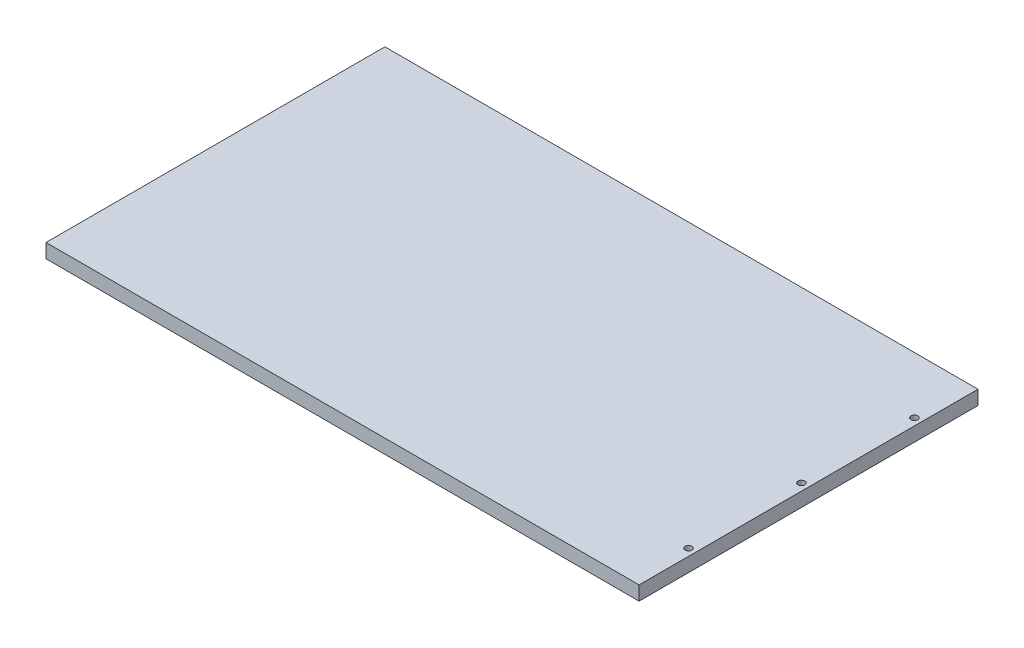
ISO-10303-21;
HEADER;
FILE_DESCRIPTION(('STEP AP214'),'2;1');
FILE_NAME('part.step','',(''),(''),'','','');
FILE_SCHEMA(('AUTOMOTIVE_DESIGN { 1 0 10303 214 1 1 1 1 }'));
ENDSEC;
DATA;
#1=APPLICATION_CONTEXT('core data for automotive mechanical design processes');
#2=APPLICATION_PROTOCOL_DEFINITION('international standard','automotive_design',2000,#1);
#3=PRODUCT_CONTEXT('',#1,'mechanical');
#4=PRODUCT('Part','Part','',(#3));
#5=PRODUCT_RELATED_PRODUCT_CATEGORY('part','',(#4));
#6=PRODUCT_DEFINITION_FORMATION('','',#4);
#7=PRODUCT_DEFINITION_CONTEXT('part definition',#1,'design');
#8=PRODUCT_DEFINITION('design','',#6,#7);
#9=PRODUCT_DEFINITION_SHAPE('','',#8);
#10=(LENGTH_UNIT() NAMED_UNIT(*) SI_UNIT(.MILLI.,.METRE.));
#11=(NAMED_UNIT(*) PLANE_ANGLE_UNIT() SI_UNIT($,.RADIAN.));
#12=(NAMED_UNIT(*) SI_UNIT($,.STERADIAN.) SOLID_ANGLE_UNIT());
#13=UNCERTAINTY_MEASURE_WITH_UNIT(LENGTH_MEASURE(1.E-05),#10,'distance_accuracy_value','');
#14=(GEOMETRIC_REPRESENTATION_CONTEXT(3) GLOBAL_UNCERTAINTY_ASSIGNED_CONTEXT((#13)) GLOBAL_UNIT_ASSIGNED_CONTEXT((#10,
#11,#12)) REPRESENTATION_CONTEXT('',''));
#15=CARTESIAN_POINT('',(0.,0.,0.));
#16=DIRECTION('',(0.,0.,1.));
#17=DIRECTION('',(1.,0.,0.));
#18=AXIS2_PLACEMENT_3D('',#15,#16,#17);
#19=CARTESIAN_POINT('',(133.35,6.35,76.2));
#20=DIRECTION('',(-1.,0.,0.));
#21=DIRECTION('',(0.,0.,1.));
#22=AXIS2_PLACEMENT_3D('',#19,#20,#21);
#23=PLANE('',#22);
#24=DIRECTION('',(0.,0.,-1.));
#25=VECTOR('',#24,1.);
#26=CARTESIAN_POINT('',(133.35,0.,76.2));
#27=LINE('',#26,#25);
#28=CARTESIAN_POINT('',(133.35,0.,76.2));
#29=VERTEX_POINT('',#28);
#30=CARTESIAN_POINT('',(133.35,0.,-76.2));
#31=VERTEX_POINT('',#30);
#32=EDGE_CURVE('E123',#29,#31,#27,.T.);
#33=ORIENTED_EDGE('',*,*,#32,.T.);
#34=DIRECTION('',(0.,-1.,0.));
#35=VECTOR('',#34,1.);
#36=CARTESIAN_POINT('',(133.35,6.35,-76.2));
#37=LINE('',#36,#35);
#38=CARTESIAN_POINT('',(133.35,6.35,-76.2));
#39=VERTEX_POINT('',#38);
#40=EDGE_CURVE('E11',#39,#31,#37,.T.);
#41=ORIENTED_EDGE('',*,*,#40,.F.);
#42=DIRECTION('',(0.,0.,-1.));
#43=VECTOR('',#42,1.);
#44=CARTESIAN_POINT('',(133.35,6.35,76.2));
#45=LINE('',#44,#43);
#46=CARTESIAN_POINT('',(133.35,6.35,76.2));
#47=VERTEX_POINT('',#46);
#48=EDGE_CURVE('E124',#47,#39,#45,.T.);
#49=ORIENTED_EDGE('',*,*,#48,.F.);
#50=DIRECTION('',(0.,-1.,0.));
#51=VECTOR('',#50,1.);
#52=CARTESIAN_POINT('',(133.35,6.35,76.2));
#53=LINE('',#52,#51);
#54=EDGE_CURVE('E130',#47,#29,#53,.T.);
#55=ORIENTED_EDGE('',*,*,#54,.T.);
#56=EDGE_LOOP('',(#33,#41,#49,#55));
#57=FACE_BOUND('',#56,.T.);
#58=ADVANCED_FACE('F37',(#57),#23,.F.);
#59=CARTESIAN_POINT('',(-133.35,6.35,-76.2));
#60=DIRECTION('',(0.,0.,1.));
#61=DIRECTION('',(1.,0.,0.));
#62=AXIS2_PLACEMENT_3D('',#59,#60,#61);
#63=PLANE('',#62);
#64=DIRECTION('',(-1.,0.,0.));
#65=VECTOR('',#64,1.);
#66=CARTESIAN_POINT('',(-133.35,0.,-76.2));
#67=LINE('',#66,#65);
#68=CARTESIAN_POINT('',(-133.35,0.,-76.2));
#69=VERTEX_POINT('',#68);
#70=EDGE_CURVE('E133',#31,#69,#67,.T.);
#71=ORIENTED_EDGE('',*,*,#70,.T.);
#72=DIRECTION('',(0.,-1.,0.));
#73=VECTOR('',#72,1.);
#74=CARTESIAN_POINT('',(-133.35,6.35,-76.2));
#75=LINE('',#74,#73);
#76=CARTESIAN_POINT('',(-133.35,6.35,-76.2));
#77=VERTEX_POINT('',#76);
#78=EDGE_CURVE('E45',#77,#69,#75,.T.);
#79=ORIENTED_EDGE('',*,*,#78,.F.);
#80=DIRECTION('',(-1.,0.,0.));
#81=VECTOR('',#80,1.);
#82=CARTESIAN_POINT('',(-133.35,6.35,-76.2));
#83=LINE('',#82,#81);
#84=EDGE_CURVE('E84',#39,#77,#83,.T.);
#85=ORIENTED_EDGE('',*,*,#84,.F.);
#86=ORIENTED_EDGE('',*,*,#40,.T.);
#87=EDGE_LOOP('',(#71,#79,#85,#86));
#88=FACE_BOUND('',#87,.T.);
#89=ADVANCED_FACE('F157',(#88),#63,.F.);
#90=CARTESIAN_POINT('',(-133.35,6.35,76.2));
#91=DIRECTION('',(1.,0.,0.));
#92=DIRECTION('',(0.,0.,-1.));
#93=AXIS2_PLACEMENT_3D('',#90,#91,#92);
#94=PLANE('',#93);
#95=CARTESIAN_POINT('',(-133.35,3.175,0.));
#96=DIRECTION('',(-1.,0.,0.));
#97=DIRECTION('',(0.,0.,1.));
#98=AXIS2_PLACEMENT_3D('',#95,#96,#97);
#99=CIRCLE('',#98,1.13029999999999);
#100=CARTESIAN_POINT('',(-133.35,3.175,1.13029999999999));
#101=VERTEX_POINT('',#100);
#102=EDGE_CURVE('E105',#101,#101,#99,.T.);
#103=ORIENTED_EDGE('',*,*,#102,.F.);
#104=EDGE_LOOP('',(#103));
#105=FACE_BOUND('',#104,.T.);
#106=CARTESIAN_POINT('',(-133.35,3.175,-50.8));
#107=DIRECTION('',(-1.,0.,0.));
#108=DIRECTION('',(0.,0.,1.));
#109=AXIS2_PLACEMENT_3D('',#106,#107,#108);
#110=CIRCLE('',#109,1.13029999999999);
#111=CARTESIAN_POINT('',(-133.35,3.175,-49.6697));
#112=VERTEX_POINT('',#111);
#113=EDGE_CURVE('E104',#112,#112,#110,.T.);
#114=ORIENTED_EDGE('',*,*,#113,.F.);
#115=EDGE_LOOP('',(#114));
#116=FACE_BOUND('',#115,.T.);
#117=CARTESIAN_POINT('',(-133.35,3.175,50.8));
#118=DIRECTION('',(-1.,0.,0.));
#119=DIRECTION('',(0.,0.,1.));
#120=AXIS2_PLACEMENT_3D('',#117,#118,#119);
#121=CIRCLE('',#120,1.13029999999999);
#122=CARTESIAN_POINT('',(-133.35,3.175,51.9303));
#123=VERTEX_POINT('',#122);
#124=EDGE_CURVE('E117',#123,#123,#121,.T.);
#125=ORIENTED_EDGE('',*,*,#124,.F.);
#126=EDGE_LOOP('',(#125));
#127=FACE_BOUND('',#126,.T.);
#128=DIRECTION('',(0.,0.,1.));
#129=VECTOR('',#128,1.);
#130=CARTESIAN_POINT('',(-133.35,0.,76.2));
#131=LINE('',#130,#129);
#132=CARTESIAN_POINT('',(-133.35,0.,76.2));
#133=VERTEX_POINT('',#132);
#134=EDGE_CURVE('E71',#69,#133,#131,.T.);
#135=ORIENTED_EDGE('',*,*,#134,.T.);
#136=DIRECTION('',(0.,-1.,0.));
#137=VECTOR('',#136,1.);
#138=CARTESIAN_POINT('',(-133.35,6.35,76.2));
#139=LINE('',#138,#137);
#140=CARTESIAN_POINT('',(-133.35,6.35,76.2));
#141=VERTEX_POINT('',#140);
#142=EDGE_CURVE('E138',#141,#133,#139,.T.);
#143=ORIENTED_EDGE('',*,*,#142,.F.);
#144=DIRECTION('',(0.,0.,1.));
#145=VECTOR('',#144,1.);
#146=CARTESIAN_POINT('',(-133.35,6.35,76.2));
#147=LINE('',#146,#145);
#148=EDGE_CURVE('E127',#77,#141,#147,.T.);
#149=ORIENTED_EDGE('',*,*,#148,.F.);
#150=ORIENTED_EDGE('',*,*,#78,.T.);
#151=EDGE_LOOP('',(#135,#143,#149,#150));
#152=FACE_BOUND('',#151,.T.);
#153=ADVANCED_FACE('F140',(#105,#116,#127,#152),#94,.F.);
#154=CARTESIAN_POINT('',(-133.35,6.35,76.2));
#155=DIRECTION('',(0.,0.,-1.));
#156=DIRECTION('',(-1.,0.,0.));
#157=AXIS2_PLACEMENT_3D('',#154,#155,#156);
#158=PLANE('',#157);
#159=DIRECTION('',(1.,0.,0.));
#160=VECTOR('',#159,1.);
#161=CARTESIAN_POINT('',(-133.35,0.,76.2));
#162=LINE('',#161,#160);
#163=EDGE_CURVE('E77',#133,#29,#162,.T.);
#164=ORIENTED_EDGE('',*,*,#163,.T.);
#165=ORIENTED_EDGE('',*,*,#54,.F.);
#166=DIRECTION('',(1.,0.,0.));
#167=VECTOR('',#166,1.);
#168=CARTESIAN_POINT('',(-133.35,6.35,76.2));
#169=LINE('',#168,#167);
#170=EDGE_CURVE('E53',#141,#47,#169,.T.);
#171=ORIENTED_EDGE('',*,*,#170,.F.);
#172=ORIENTED_EDGE('',*,*,#142,.T.);
#173=EDGE_LOOP('',(#164,#165,#171,#172));
#174=FACE_BOUND('',#173,.T.);
#175=ADVANCED_FACE('F147',(#174),#158,.F.);
#176=CARTESIAN_POINT('',(0.,6.35,0.));
#177=DIRECTION('',(0.,-1.,0.));
#178=DIRECTION('',(0.,0.,-1.));
#179=AXIS2_PLACEMENT_3D('',#176,#177,#178);
#180=PLANE('',#179);
#181=CARTESIAN_POINT('',(130.175,6.35,0.));
#182=DIRECTION('',(0.,1.,0.));
#183=DIRECTION('',(0.,0.,1.));
#184=AXIS2_PLACEMENT_3D('',#181,#182,#183);
#185=CIRCLE('',#184,1.524);
#186=CARTESIAN_POINT('',(130.175,6.35,1.52400000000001));
#187=VERTEX_POINT('',#186);
#188=EDGE_CURVE('E318',#187,#187,#185,.T.);
#189=ORIENTED_EDGE('',*,*,#188,.F.);
#190=EDGE_LOOP('',(#189));
#191=FACE_BOUND('',#190,.T.);
#192=CARTESIAN_POINT('',(130.175,6.35,-50.8));
#193=DIRECTION('',(0.,1.,0.));
#194=DIRECTION('',(0.,0.,1.));
#195=AXIS2_PLACEMENT_3D('',#192,#193,#194);
#196=CIRCLE('',#195,1.524);
#197=CARTESIAN_POINT('',(130.175,6.35,-49.276));
#198=VERTEX_POINT('',#197);
#199=EDGE_CURVE('E320',#198,#198,#196,.T.);
#200=ORIENTED_EDGE('',*,*,#199,.F.);
#201=EDGE_LOOP('',(#200));
#202=FACE_BOUND('',#201,.T.);
#203=CARTESIAN_POINT('',(130.175,6.35,50.8));
#204=DIRECTION('',(0.,1.,0.));
#205=DIRECTION('',(0.,0.,1.));
#206=AXIS2_PLACEMENT_3D('',#203,#204,#205);
#207=CIRCLE('',#206,1.524);
#208=CARTESIAN_POINT('',(130.175,6.35,52.324));
#209=VERTEX_POINT('',#208);
#210=EDGE_CURVE('E328',#209,#209,#207,.T.);
#211=ORIENTED_EDGE('',*,*,#210,.F.);
#212=EDGE_LOOP('',(#211));
#213=FACE_BOUND('',#212,.T.);
#214=ORIENTED_EDGE('',*,*,#48,.T.);
#215=ORIENTED_EDGE('',*,*,#84,.T.);
#216=ORIENTED_EDGE('',*,*,#148,.T.);
#217=ORIENTED_EDGE('',*,*,#170,.T.);
#218=EDGE_LOOP('',(#214,#215,#216,#217));
#219=FACE_BOUND('',#218,.T.);
#220=ADVANCED_FACE('F149',(#191,#202,#213,#219),#180,.F.);
#221=CARTESIAN_POINT('',(0.,0.,0.));
#222=DIRECTION('',(0.,-1.,0.));
#223=DIRECTION('',(0.,0.,-1.));
#224=AXIS2_PLACEMENT_3D('',#221,#222,#223);
#225=PLANE('',#224);
#226=CARTESIAN_POINT('',(130.175,0.,0.));
#227=DIRECTION('',(0.,1.,0.));
#228=DIRECTION('',(0.,0.,1.));
#229=AXIS2_PLACEMENT_3D('',#226,#227,#228);
#230=CIRCLE('',#229,1.524);
#231=CARTESIAN_POINT('',(130.175,0.,1.52400000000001));
#232=VERTEX_POINT('',#231);
#233=EDGE_CURVE('E315',#232,#232,#230,.T.);
#234=ORIENTED_EDGE('',*,*,#233,.T.);
#235=EDGE_LOOP('',(#234));
#236=FACE_BOUND('',#235,.T.);
#237=CARTESIAN_POINT('',(130.175,0.,-50.8));
#238=DIRECTION('',(0.,1.,0.));
#239=DIRECTION('',(0.,0.,1.));
#240=AXIS2_PLACEMENT_3D('',#237,#238,#239);
#241=CIRCLE('',#240,1.524);
#242=CARTESIAN_POINT('',(130.175,0.,-49.276));
#243=VERTEX_POINT('',#242);
#244=EDGE_CURVE('E325',#243,#243,#241,.T.);
#245=ORIENTED_EDGE('',*,*,#244,.T.);
#246=EDGE_LOOP('',(#245));
#247=FACE_BOUND('',#246,.T.);
#248=CARTESIAN_POINT('',(130.175,0.,50.8));
#249=DIRECTION('',(0.,1.,0.));
#250=DIRECTION('',(0.,0.,1.));
#251=AXIS2_PLACEMENT_3D('',#248,#249,#250);
#252=CIRCLE('',#251,1.524);
#253=CARTESIAN_POINT('',(130.175,0.,52.324));
#254=VERTEX_POINT('',#253);
#255=EDGE_CURVE('E111',#254,#254,#252,.T.);
#256=ORIENTED_EDGE('',*,*,#255,.T.);
#257=EDGE_LOOP('',(#256));
#258=FACE_BOUND('',#257,.T.);
#259=ORIENTED_EDGE('',*,*,#32,.F.);
#260=ORIENTED_EDGE('',*,*,#163,.F.);
#261=ORIENTED_EDGE('',*,*,#134,.F.);
#262=ORIENTED_EDGE('',*,*,#70,.F.);
#263=EDGE_LOOP('',(#259,#260,#261,#262));
#264=FACE_BOUND('',#263,.T.);
#265=ADVANCED_FACE('F143',(#236,#247,#258,#264),#225,.T.);
#266=CARTESIAN_POINT('',(-125.73,3.175,50.8));
#267=DIRECTION('',(-1.,0.,0.));
#268=DIRECTION('',(0.,0.,1.));
#269=AXIS2_PLACEMENT_3D('',#266,#267,#268);
#270=CONICAL_SURFACE('',#269,1.1303,1.02974425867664);
#271=CARTESIAN_POINT('',(-125.050847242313,3.175,50.8));
#272=VERTEX_POINT('',#271);
#273=VERTEX_LOOP('',#272);
#274=FACE_BOUND('',#273,.T.);
#275=CARTESIAN_POINT('',(-125.73,3.175,50.8));
#276=DIRECTION('',(-1.,0.,0.));
#277=DIRECTION('',(0.,0.,1.));
#278=AXIS2_PLACEMENT_3D('',#275,#276,#277);
#279=CIRCLE('',#278,1.1303);
#280=CARTESIAN_POINT('',(-125.73,3.175,51.9303));
#281=VERTEX_POINT('',#280);
#282=EDGE_CURVE('E120',#281,#281,#279,.T.);
#283=ORIENTED_EDGE('',*,*,#282,.T.);
#284=EDGE_LOOP('',(#283));
#285=FACE_BOUND('',#284,.T.);
#286=ADVANCED_FACE('F179',(#274,#285),#270,.F.);
#287=CARTESIAN_POINT('',(-133.35,3.175,50.8));
#288=DIRECTION('',(-1.,0.,0.));
#289=DIRECTION('',(0.,0.,1.));
#290=AXIS2_PLACEMENT_3D('',#287,#288,#289);
#291=CYLINDRICAL_SURFACE('',#290,1.13029999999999);
#292=ORIENTED_EDGE('',*,*,#282,.F.);
#293=EDGE_LOOP('',(#292));
#294=FACE_BOUND('',#293,.T.);
#295=ORIENTED_EDGE('',*,*,#124,.T.);
#296=EDGE_LOOP('',(#295));
#297=FACE_BOUND('',#296,.T.);
#298=ADVANCED_FACE('F184',(#294,#297),#291,.F.);
#299=CARTESIAN_POINT('',(-125.73,3.175,-50.8));
#300=DIRECTION('',(-1.,0.,0.));
#301=DIRECTION('',(0.,0.,1.));
#302=AXIS2_PLACEMENT_3D('',#299,#300,#301);
#303=CONICAL_SURFACE('',#302,1.1303,1.02974425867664);
#304=CARTESIAN_POINT('',(-125.050847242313,3.175,-50.8));
#305=VERTEX_POINT('',#304);
#306=VERTEX_LOOP('',#305);
#307=FACE_BOUND('',#306,.T.);
#308=CARTESIAN_POINT('',(-125.73,3.175,-50.8));
#309=DIRECTION('',(-1.,0.,0.));
#310=DIRECTION('',(0.,0.,1.));
#311=AXIS2_PLACEMENT_3D('',#308,#309,#310);
#312=CIRCLE('',#311,1.1303);
#313=CARTESIAN_POINT('',(-125.73,3.175,-49.6697));
#314=VERTEX_POINT('',#313);
#315=EDGE_CURVE('E108',#314,#314,#312,.T.);
#316=ORIENTED_EDGE('',*,*,#315,.T.);
#317=EDGE_LOOP('',(#316));
#318=FACE_BOUND('',#317,.T.);
#319=ADVANCED_FACE('F197',(#307,#318),#303,.F.);
#320=CARTESIAN_POINT('',(-133.35,3.175,-50.8));
#321=DIRECTION('',(-1.,0.,0.));
#322=DIRECTION('',(0.,0.,1.));
#323=AXIS2_PLACEMENT_3D('',#320,#321,#322);
#324=CYLINDRICAL_SURFACE('',#323,1.13029999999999);
#325=ORIENTED_EDGE('',*,*,#315,.F.);
#326=EDGE_LOOP('',(#325));
#327=FACE_BOUND('',#326,.T.);
#328=ORIENTED_EDGE('',*,*,#113,.T.);
#329=EDGE_LOOP('',(#328));
#330=FACE_BOUND('',#329,.T.);
#331=ADVANCED_FACE('F98',(#327,#330),#324,.F.);
#332=CARTESIAN_POINT('',(-125.73,3.175,0.));
#333=DIRECTION('',(-1.,0.,0.));
#334=DIRECTION('',(0.,0.,1.));
#335=AXIS2_PLACEMENT_3D('',#332,#333,#334);
#336=CONICAL_SURFACE('',#335,1.1303,1.02974425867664);
#337=CARTESIAN_POINT('',(-125.050847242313,3.175,0.));
#338=VERTEX_POINT('',#337);
#339=VERTEX_LOOP('',#338);
#340=FACE_BOUND('',#339,.T.);
#341=CARTESIAN_POINT('',(-125.73,3.175,0.));
#342=DIRECTION('',(-1.,0.,0.));
#343=DIRECTION('',(0.,0.,1.));
#344=AXIS2_PLACEMENT_3D('',#341,#342,#343);
#345=CIRCLE('',#344,1.1303);
#346=CARTESIAN_POINT('',(-125.73,3.175,1.1303));
#347=VERTEX_POINT('',#346);
#348=EDGE_CURVE('E102',#347,#347,#345,.T.);
#349=ORIENTED_EDGE('',*,*,#348,.T.);
#350=EDGE_LOOP('',(#349));
#351=FACE_BOUND('',#350,.T.);
#352=ADVANCED_FACE('F94',(#340,#351),#336,.F.);
#353=CARTESIAN_POINT('',(-133.35,3.175,0.));
#354=DIRECTION('',(-1.,0.,0.));
#355=DIRECTION('',(0.,0.,1.));
#356=AXIS2_PLACEMENT_3D('',#353,#354,#355);
#357=CYLINDRICAL_SURFACE('',#356,1.13029999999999);
#358=ORIENTED_EDGE('',*,*,#348,.F.);
#359=EDGE_LOOP('',(#358));
#360=FACE_BOUND('',#359,.T.);
#361=ORIENTED_EDGE('',*,*,#102,.T.);
#362=EDGE_LOOP('',(#361));
#363=FACE_BOUND('',#362,.T.);
#364=ADVANCED_FACE('F97',(#360,#363),#357,.F.);
#365=CARTESIAN_POINT('',(130.175,6.35,50.8));
#366=DIRECTION('',(0.,1.,0.));
#367=DIRECTION('',(0.,0.,1.));
#368=AXIS2_PLACEMENT_3D('',#365,#366,#367);
#369=CYLINDRICAL_SURFACE('',#368,1.524);
#370=ORIENTED_EDGE('',*,*,#255,.F.);
#371=EDGE_LOOP('',(#370));
#372=FACE_BOUND('',#371,.T.);
#373=ORIENTED_EDGE('',*,*,#210,.T.);
#374=EDGE_LOOP('',(#373));
#375=FACE_BOUND('',#374,.T.);
#376=ADVANCED_FACE('F235',(#372,#375),#369,.F.);
#377=CARTESIAN_POINT('',(130.175,6.35,-50.8));
#378=DIRECTION('',(0.,1.,0.));
#379=DIRECTION('',(0.,0.,1.));
#380=AXIS2_PLACEMENT_3D('',#377,#378,#379);
#381=CYLINDRICAL_SURFACE('',#380,1.524);
#382=ORIENTED_EDGE('',*,*,#244,.F.);
#383=EDGE_LOOP('',(#382));
#384=FACE_BOUND('',#383,.T.);
#385=ORIENTED_EDGE('',*,*,#199,.T.);
#386=EDGE_LOOP('',(#385));
#387=FACE_BOUND('',#386,.T.);
#388=ADVANCED_FACE('F259',(#384,#387),#381,.F.);
#389=CARTESIAN_POINT('',(130.175,6.35,0.));
#390=DIRECTION('',(0.,1.,0.));
#391=DIRECTION('',(0.,0.,1.));
#392=AXIS2_PLACEMENT_3D('',#389,#390,#391);
#393=CYLINDRICAL_SURFACE('',#392,1.524);
#394=ORIENTED_EDGE('',*,*,#233,.F.);
#395=EDGE_LOOP('',(#394));
#396=FACE_BOUND('',#395,.T.);
#397=ORIENTED_EDGE('',*,*,#188,.T.);
#398=EDGE_LOOP('',(#397));
#399=FACE_BOUND('',#398,.T.);
#400=ADVANCED_FACE('F270',(#396,#399),#393,.F.);
#401=CLOSED_SHELL('',(#58,#89,#153,#175,#220,#265,#286,#298,#319,#331,#352,#364,#376,#388,#400));
#402=MANIFOLD_SOLID_BREP('B2',#401);
#403=ADVANCED_BREP_SHAPE_REPRESENTATION('',(#18,#402),#14);
#404=SHAPE_DEFINITION_REPRESENTATION(#9,#403);
ENDSEC;
END-ISO-10303-21;
